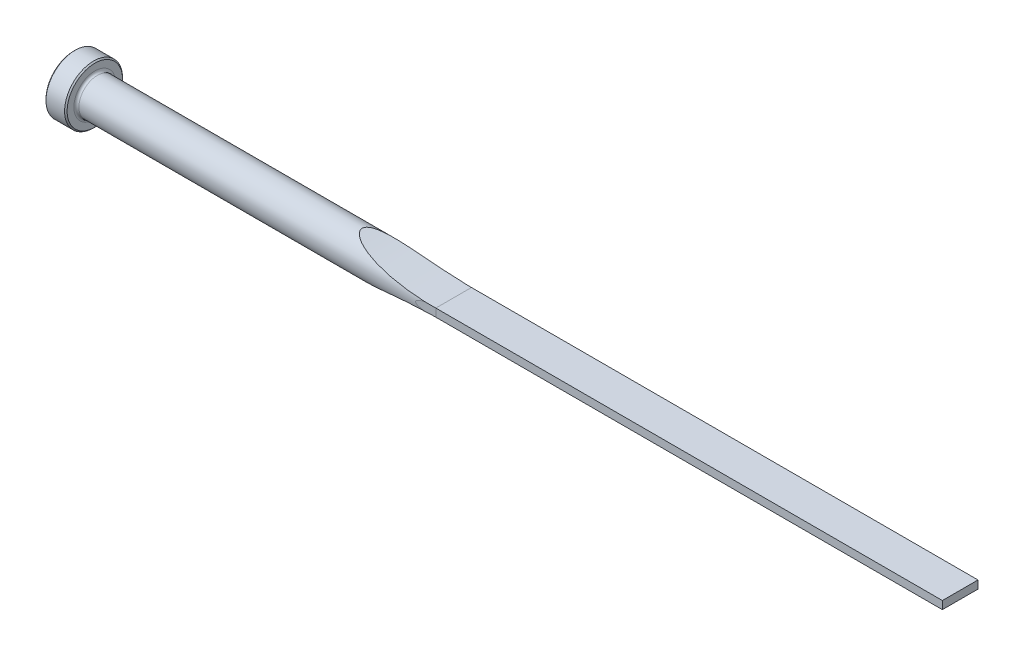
ISO-10303-21;
HEADER;
FILE_DESCRIPTION(('STEP AP214'),'2;1');
FILE_NAME('part.step','',(''),(''),'','','');
FILE_SCHEMA(('AUTOMOTIVE_DESIGN { 1 0 10303 214 1 1 1 1 }'));
ENDSEC;
DATA;
#1=APPLICATION_CONTEXT('core data for automotive mechanical design processes');
#2=APPLICATION_PROTOCOL_DEFINITION('international standard','automotive_design',2000,#1);
#3=PRODUCT_CONTEXT('',#1,'mechanical');
#4=PRODUCT('Part','Part','',(#3));
#5=PRODUCT_RELATED_PRODUCT_CATEGORY('part','',(#4));
#6=PRODUCT_DEFINITION_FORMATION('','',#4);
#7=PRODUCT_DEFINITION_CONTEXT('part definition',#1,'design');
#8=PRODUCT_DEFINITION('design','',#6,#7);
#9=PRODUCT_DEFINITION_SHAPE('','',#8);
#10=(LENGTH_UNIT() NAMED_UNIT(*) SI_UNIT(.MILLI.,.METRE.));
#11=(NAMED_UNIT(*) PLANE_ANGLE_UNIT() SI_UNIT($,.RADIAN.));
#12=(NAMED_UNIT(*) SI_UNIT($,.STERADIAN.) SOLID_ANGLE_UNIT());
#13=UNCERTAINTY_MEASURE_WITH_UNIT(LENGTH_MEASURE(1.E-05),#10,'distance_accuracy_value','');
#14=(GEOMETRIC_REPRESENTATION_CONTEXT(3) GLOBAL_UNCERTAINTY_ASSIGNED_CONTEXT((#13)) GLOBAL_UNIT_ASSIGNED_CONTEXT((#10,
#11,#12)) REPRESENTATION_CONTEXT('',''));
#15=CARTESIAN_POINT('',(0.,0.,0.));
#16=DIRECTION('',(0.,0.,1.));
#17=DIRECTION('',(1.,0.,0.));
#18=AXIS2_PLACEMENT_3D('',#15,#16,#17);
#19=CARTESIAN_POINT('',(0.,0.,0.));
#20=DIRECTION('',(-1.,0.,0.));
#21=DIRECTION('',(0.,0.,1.));
#22=AXIS2_PLACEMENT_3D('',#19,#20,#21);
#23=CYLINDRICAL_SURFACE('',#22,5.55625);
#24=CARTESIAN_POINT('',(7.112,0.,0.));
#25=DIRECTION('',(-1.,0.,0.));
#26=DIRECTION('',(0.,0.,1.));
#27=AXIS2_PLACEMENT_3D('',#24,#25,#26);
#28=CIRCLE('',#27,5.55625);
#29=CARTESIAN_POINT('',(7.112,0.,5.55625));
#30=VERTEX_POINT('',#29);
#31=EDGE_CURVE('E153',#30,#30,#28,.F.);
#32=ORIENTED_EDGE('',*,*,#31,.T.);
#33=EDGE_LOOP('',(#32));
#34=FACE_BOUND('',#33,.T.);
#35=CARTESIAN_POINT('',(114.3,1.46586005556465,5.3594));
#36=CARTESIAN_POINT('',(114.030271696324,1.46575873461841,5.35939756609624));
#37=CARTESIAN_POINT('',(113.760518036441,1.46136420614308,5.36062746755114));
#38=CARTESIAN_POINT('',(113.22105926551,1.44329060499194,5.36553852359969));
#39=CARTESIAN_POINT('',(112.951354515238,1.42960160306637,5.36922229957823));
#40=CARTESIAN_POINT('',(112.410495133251,1.39208721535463,5.37906724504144));
#41=CARTESIAN_POINT('',(112.139346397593,1.36818081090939,5.38524819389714));
#42=CARTESIAN_POINT('',(111.598495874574,1.30859070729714,5.40004505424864));
#43=CARTESIAN_POINT('',(111.328793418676,1.27291303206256,5.40865971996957));
#44=CARTESIAN_POINT('',(110.926651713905,1.20828013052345,5.42332376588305));
#45=CARTESIAN_POINT('',(110.793273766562,1.1849414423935,5.42848992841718));
#46=CARTESIAN_POINT('',(110.527337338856,1.13387487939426,5.43938691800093));
#47=CARTESIAN_POINT('',(110.394779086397,1.10614583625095,5.44511789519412));
#48=CARTESIAN_POINT('',(110.130841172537,1.0453518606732,5.45711645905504));
#49=CARTESIAN_POINT('',(109.999461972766,1.01228492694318,5.46338424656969));
#50=CARTESIAN_POINT('',(109.738710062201,0.939342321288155,5.47639670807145));
#51=CARTESIAN_POINT('',(109.609336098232,0.899471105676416,5.48314106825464));
#52=CARTESIAN_POINT('',(109.35297395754,0.810175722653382,5.49705768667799));
#53=CARTESIAN_POINT('',(109.226002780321,0.760700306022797,5.50423209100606));
#54=CARTESIAN_POINT('',(109.040600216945,0.675638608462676,5.51508991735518));
#55=CARTESIAN_POINT('',(108.979683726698,0.645502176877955,5.51872258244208));
#56=CARTESIAN_POINT('',(108.860503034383,0.580424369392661,5.52594854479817));
#57=CARTESIAN_POINT('',(108.802234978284,0.545490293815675,5.52954189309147));
#58=CARTESIAN_POINT('',(108.701530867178,0.476724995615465,5.53584531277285));
#59=CARTESIAN_POINT('',(108.65827903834,0.444104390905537,5.53858683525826));
#60=CARTESIAN_POINT('',(108.57667277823,0.373234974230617,5.54381419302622));
#61=CARTESIAN_POINT('',(108.538296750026,0.335012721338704,5.5463011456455));
#62=CARTESIAN_POINT('',(108.487931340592,0.27269036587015,5.54959140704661));
#63=CARTESIAN_POINT('',(108.472506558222,0.251407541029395,5.55060383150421));
#64=CARTESIAN_POINT('',(108.444620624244,0.206926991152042,5.55244015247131));
#65=CARTESIAN_POINT('',(108.432159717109,0.183729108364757,5.55326403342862));
#66=CARTESIAN_POINT('',(108.411107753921,0.135176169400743,5.55465907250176));
#67=CARTESIAN_POINT('',(108.402575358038,0.109794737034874,5.5552263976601));
#68=CARTESIAN_POINT('',(108.390813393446,0.0578395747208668,5.55600913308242));
#69=CARTESIAN_POINT('',(108.387570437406,0.0312690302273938,5.55622543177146));
#70=CARTESIAN_POINT('',(108.386942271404,-0.0180209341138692,5.55626732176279));
#71=CARTESIAN_POINT('',(108.388766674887,-0.0407328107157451,5.55614563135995));
#72=CARTESIAN_POINT('',(108.396395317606,-0.085481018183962,5.55563758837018));
#73=CARTESIAN_POINT('',(108.402204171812,-0.107516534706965,5.5552509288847));
#74=CARTESIAN_POINT('',(108.419168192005,-0.156049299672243,5.5541244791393));
#75=CARTESIAN_POINT('',(108.431330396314,-0.18218719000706,5.55331838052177));
#76=CARTESIAN_POINT('',(108.459602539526,-0.232205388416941,5.55145244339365));
#77=CARTESIAN_POINT('',(108.475720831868,-0.256080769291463,5.55039206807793));
#78=CARTESIAN_POINT('',(108.523752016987,-0.318666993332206,5.54724818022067));
#79=CARTESIAN_POINT('',(108.558484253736,-0.355174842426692,5.54499107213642));
#80=CARTESIAN_POINT('',(108.63259156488,-0.423044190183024,5.54022572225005));
#81=CARTESIAN_POINT('',(108.671980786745,-0.454389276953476,5.5377167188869));
#82=CARTESIAN_POINT('',(108.774080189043,-0.527971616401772,5.53128741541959));
#83=CARTESIAN_POINT('',(108.838542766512,-0.567741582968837,5.5272928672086));
#84=CARTESIAN_POINT('',(108.970872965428,-0.641234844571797,5.51924650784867));
#85=CARTESIAN_POINT('',(109.038748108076,-0.67494396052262,5.51519458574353));
#86=CARTESIAN_POINT('',(109.176924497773,-0.738013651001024,5.50711039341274));
#87=CARTESIAN_POINT('',(109.247237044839,-0.767349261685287,5.50307835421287));
#88=CARTESIAN_POINT('',(109.389142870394,-0.822439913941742,5.4951136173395));
#89=CARTESIAN_POINT('',(109.46073462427,-0.848198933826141,5.49118081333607));
#90=CARTESIAN_POINT('',(109.669352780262,-0.91867444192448,5.47997799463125));
#91=CARTESIAN_POINT('',(109.807620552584,-0.959734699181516,5.47287002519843));
#92=CARTESIAN_POINT('',(110.086165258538,-1.03455813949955,5.45921359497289));
#93=CARTESIAN_POINT('',(110.22644336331,-1.06831686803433,5.45266547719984));
#94=CARTESIAN_POINT('',(110.649735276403,-1.16124457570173,5.43392318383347));
#95=CARTESIAN_POINT('',(110.934656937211,-1.21189726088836,5.42266076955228));
#96=CARTESIAN_POINT('',(111.506839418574,-1.29737509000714,5.40282806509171));
#97=CARTESIAN_POINT('',(111.794100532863,-1.33219821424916,5.39425811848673));
#98=CARTESIAN_POINT('',(112.369614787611,-1.3890650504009,5.37989532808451));
#99=CARTESIAN_POINT('',(112.657866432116,-1.41112322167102,5.37409934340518));
#100=CARTESIAN_POINT('',(113.172284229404,-1.4405827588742,5.36626590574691));
#101=CARTESIAN_POINT('',(113.398325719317,-1.45012786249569,5.36368531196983));
#102=CARTESIAN_POINT('',(113.849579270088,-1.46273038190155,5.36025582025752));
#103=CARTESIAN_POINT('',(114.074790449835,-1.46581699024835,5.35939913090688));
#104=CARTESIAN_POINT('',(114.3,-1.46586005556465,5.3594));
#105=B_SPLINE_CURVE_WITH_KNOTS('',3,(#35,#36,#37,#38,#39,#40,#41,#42,#43,#44,#45,#46,#47,#48,
#49,#50,#51,#52,#53,#54,#55,#56,#57,#58,#59,#60,#61,#62,#63,#64,#65,#66,#67,#68,#69,#70,#71,#72,
#73,#74,#75,#76,#77,#78,#79,#80,#81,#82,#83,#84,#85,#86,#87,#88,#89,#90,#91,#92,#93,#94,#95,#96,
#97,#98,#99,#100,#101,#102,#103,#104),.UNSPECIFIED.,.F.,.F.,(4,2,2,2,2,2,2,2,2,2,2,2,2,2,2,2,2,
2,2,2,2,2,2,2,2,2,2,2,2,2,2,2,2,2,4),(0.,0.809188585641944,1.61924298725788,2.43584347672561,
3.25202671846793,3.65847781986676,4.06503726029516,4.47174948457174,4.87819635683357,
5.28687485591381,5.49092082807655,5.694659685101,5.85711909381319,6.01883176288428,
6.09756631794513,6.17630736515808,6.25618880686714,6.33586775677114,6.40384405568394,
6.47189922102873,6.5579348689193,6.64415377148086,6.79462229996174,6.94556028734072,
7.17253298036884,7.40002994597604,7.62877945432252,7.85727244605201,8.29017865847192,
8.72334823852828,9.59140829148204,10.4595790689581,11.326764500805,12.0054446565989,
12.6810504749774),.UNSPECIFIED.);
#106=CARTESIAN_POINT('',(111.180420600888,1.24855125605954,5.41415125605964));
#107=VERTEX_POINT('',#106);
#108=CARTESIAN_POINT('',(111.180420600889,-1.24855125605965,5.41415125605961));
#109=VERTEX_POINT('',#108);
#110=EDGE_CURVE('E156',#107,#109,#105,.T.);
#111=ORIENTED_EDGE('',*,*,#110,.F.);
#112=CARTESIAN_POINT('',(114.3,1.19379999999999,5.42648648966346));
#113=CARTESIAN_POINT('',(113.836278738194,1.19379960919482,5.42647003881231));
#114=CARTESIAN_POINT('',(113.372557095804,1.19742828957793,5.42568766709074));
#115=CARTESIAN_POINT('',(112.445230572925,1.21194105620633,5.42247326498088));
#116=CARTESIAN_POINT('',(111.981625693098,1.22282518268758,5.42004122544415));
#117=CARTESIAN_POINT('',(111.05456158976,1.25184904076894,5.41340899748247));
#118=CARTESIAN_POINT('',(110.591102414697,1.26999023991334,5.40920845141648));
#119=CARTESIAN_POINT('',(109.664547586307,1.31352246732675,5.39880331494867));
#120=CARTESIAN_POINT('',(109.201451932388,1.33891348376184,5.39259872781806));
#121=CARTESIAN_POINT('',(108.274618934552,1.39700801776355,5.37784182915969));
#122=CARTESIAN_POINT('',(107.810882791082,1.42972926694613,5.3692838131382));
#123=CARTESIAN_POINT('',(106.884040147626,1.50243687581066,5.34939418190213));
#124=CARTESIAN_POINT('',(106.420933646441,1.54242322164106,5.33806257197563));
#125=CARTESIAN_POINT('',(105.495541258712,1.62964076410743,5.31208608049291));
#126=CARTESIAN_POINT('',(105.033255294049,1.67687122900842,5.29744153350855));
#127=CARTESIAN_POINT('',(104.109628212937,1.7785567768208,5.26417167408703));
#128=CARTESIAN_POINT('',(103.648287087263,1.83301178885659,5.24554640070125));
#129=CARTESIAN_POINT('',(102.462749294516,1.98237592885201,5.19149175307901));
#130=CARTESIAN_POINT('',(101.739369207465,2.08258931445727,5.1525481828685));
#131=CARTESIAN_POINT('',(100.296154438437,2.30066319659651,5.05895286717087));
#132=CARTESIAN_POINT('',(99.5763201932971,2.41852581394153,5.00429923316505));
#133=CARTESIAN_POINT('',(98.5002084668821,2.60831906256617,4.90648551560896));
#134=CARTESIAN_POINT('',(98.1420552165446,2.67376132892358,4.87123528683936));
#135=CARTESIAN_POINT('',(97.4272204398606,2.80891244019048,4.79457790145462));
#136=CARTESIAN_POINT('',(97.070538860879,2.87862113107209,4.75317096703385));
#137=CARTESIAN_POINT('',(96.3590122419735,3.02220506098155,4.66319279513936));
#138=CARTESIAN_POINT('',(96.0041667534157,3.09607922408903,4.61462340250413));
#139=CARTESIAN_POINT('',(95.2966165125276,3.24788864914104,4.50906707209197));
#140=CARTESIAN_POINT('',(94.9439116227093,3.3258236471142,4.4520806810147));
#141=CARTESIAN_POINT('',(94.2402644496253,3.48578947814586,4.32798668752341));
#142=CARTESIAN_POINT('',(93.8893286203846,3.56782989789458,4.26085457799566));
#143=CARTESIAN_POINT('',(93.1907815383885,3.73559284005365,4.11456616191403));
#144=CARTESIAN_POINT('',(92.8431707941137,3.82131591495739,4.0354080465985));
#145=CARTESIAN_POINT('',(92.1534736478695,3.9957895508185,3.86272579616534));
#146=CARTESIAN_POINT('',(91.8113731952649,4.08452961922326,3.76924813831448));
#147=CARTESIAN_POINT('',(91.3029301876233,4.21961545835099,3.61543612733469));
#148=CARTESIAN_POINT('',(91.1342561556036,4.26496713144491,3.56190764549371));
#149=CARTESIAN_POINT('',(90.7987815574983,4.35621823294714,3.44971264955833));
#150=CARTESIAN_POINT('',(90.6319808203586,4.40211761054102,3.39104660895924));
#151=CARTESIAN_POINT('',(90.319668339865,4.48902868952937,3.27493062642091));
#152=CARTESIAN_POINT('',(90.1739098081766,4.52999694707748,3.21811345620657));
#153=CARTESIAN_POINT('',(89.88458367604,4.6121057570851,3.09929221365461));
#154=CARTESIAN_POINT('',(89.7410158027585,4.65324628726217,3.03728879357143));
#155=CARTESIAN_POINT('',(89.4558597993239,4.73572579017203,2.90702443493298));
#156=CARTESIAN_POINT('',(89.3142851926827,4.7770647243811,2.83873370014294));
#157=CARTESIAN_POINT('',(89.0346051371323,4.85946967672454,2.69523964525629));
#158=CARTESIAN_POINT('',(88.8964991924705,4.90053573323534,2.62003732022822));
#159=CARTESIAN_POINT('',(88.6225864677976,4.98268911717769,2.46027026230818));
#160=CARTESIAN_POINT('',(88.4868524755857,5.02376614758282,2.37557431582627));
#161=CARTESIAN_POINT('',(88.2215073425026,5.10473330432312,2.19620380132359));
#162=CARTESIAN_POINT('',(88.0919015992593,5.14462237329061,2.10152066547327));
#163=CARTESIAN_POINT('',(87.8424200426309,5.22199445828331,1.90109250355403));
#164=CARTESIAN_POINT('',(87.7224760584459,5.2594938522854,1.79543978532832));
#165=CARTESIAN_POINT('',(87.4952730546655,5.33100920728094,1.5704035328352));
#166=CARTESIAN_POINT('',(87.3879841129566,5.36503335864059,1.45105375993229));
#167=CARTESIAN_POINT('',(87.221020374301,5.41827719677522,1.23397684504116));
#168=CARTESIAN_POINT('',(87.1566354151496,5.43890352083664,1.14025492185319));
#169=CARTESIAN_POINT('',(87.0403051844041,5.47629138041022,0.944493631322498));
#170=CARTESIAN_POINT('',(86.9883608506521,5.49305262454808,0.842453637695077));
#171=CARTESIAN_POINT('',(86.9002998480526,5.52153134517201,0.629482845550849));
#172=CARTESIAN_POINT('',(86.8643751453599,5.53318761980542,0.51846211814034));
#173=CARTESIAN_POINT('',(86.8133120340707,5.54977153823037,0.291274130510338));
#174=CARTESIAN_POINT('',(86.7981383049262,5.55471061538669,0.175115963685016));
#175=CARTESIAN_POINT('',(86.7909471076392,5.55705054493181,-0.0464774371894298));
#176=CARTESIAN_POINT('',(86.7967908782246,5.55514764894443,-0.151838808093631));
#177=CARTESIAN_POINT('',(86.8262526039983,5.54556861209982,-0.3597809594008));
#178=CARTESIAN_POINT('',(86.8498845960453,5.53788791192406,-0.462359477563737));
#179=CARTESIAN_POINT('',(86.9190753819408,5.51545450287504,-0.682944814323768));
#180=CARTESIAN_POINT('',(86.9681812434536,5.49956032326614,-0.79970306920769));
#181=CARTESIAN_POINT('',(87.0835728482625,5.46236530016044,-1.02343794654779));
#182=CARTESIAN_POINT('',(87.1498921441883,5.4410538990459,-1.13039490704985));
#183=CARTESIAN_POINT('',(87.2814328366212,5.39898975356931,-1.31531443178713));
#184=CARTESIAN_POINT('',(87.3445462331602,5.37887596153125,-1.3949614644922));
#185=CARTESIAN_POINT('',(87.4772025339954,5.33678035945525,-1.54822827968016));
#186=CARTESIAN_POINT('',(87.5467497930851,5.31479728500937,-1.62184391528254));
#187=CARTESIAN_POINT('',(87.6909456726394,5.26942876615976,-1.76368634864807));
#188=CARTESIAN_POINT('',(87.7656040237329,5.24604065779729,-1.83190230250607));
#189=CARTESIAN_POINT('',(87.9188279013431,5.19827477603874,-1.96334885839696));
#190=CARTESIAN_POINT('',(87.9973925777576,5.17389721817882,-2.02658053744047));
#191=CARTESIAN_POINT('',(88.1805124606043,5.1173681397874,-2.16601659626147));
#192=CARTESIAN_POINT('',(88.2860907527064,5.08498201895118,-2.24077876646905));
#193=CARTESIAN_POINT('',(88.5012459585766,5.01943855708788,-2.38397431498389));
#194=CARTESIAN_POINT('',(88.6108244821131,4.98628090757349,-2.45240510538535));
#195=CARTESIAN_POINT('',(88.9445153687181,4.88603485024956,-2.64961446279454));
#196=CARTESIAN_POINT('',(89.1733168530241,4.81825572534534,-2.77011541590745));
#197=CARTESIAN_POINT('',(89.6400743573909,4.68210518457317,-2.99450065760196));
#198=CARTESIAN_POINT('',(89.8780706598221,4.61373250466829,-3.09829825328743));
#199=CARTESIAN_POINT('',(90.2392238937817,4.51164813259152,-3.24351905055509));
#200=CARTESIAN_POINT('',(90.3602534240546,4.4777122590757,-3.29016389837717));
#201=CARTESIAN_POINT('',(90.6035394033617,4.4100577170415,-3.38030843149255));
#202=CARTESIAN_POINT('',(90.7257958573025,4.37633904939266,-3.42380810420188));
#203=CARTESIAN_POINT('',(91.0470474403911,4.28848246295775,-3.53389507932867));
#204=CARTESIAN_POINT('',(91.2468924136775,4.23456967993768,-3.59818566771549));
#205=CARTESIAN_POINT('',(91.6487914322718,4.12766698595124,-3.72032881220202));
#206=CARTESIAN_POINT('',(91.8508457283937,4.07467718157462,-3.77818062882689));
#207=CARTESIAN_POINT('',(92.4598643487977,3.91727056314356,-3.9433687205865));
#208=CARTESIAN_POINT('',(92.8695359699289,3.81445719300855,-4.04228829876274));
#209=CARTESIAN_POINT('',(93.6946456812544,3.61368582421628,-4.22271910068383));
#210=CARTESIAN_POINT('',(94.1100933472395,3.51573754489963,-4.30419647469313));
#211=CARTESIAN_POINT('',(94.9447952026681,3.32531890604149,-4.45294934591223));
#212=CARTESIAN_POINT('',(95.3640498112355,3.23284915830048,-4.52022325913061));
#213=CARTESIAN_POINT('',(96.2069579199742,3.05336000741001,-4.64335849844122));
#214=CARTESIAN_POINT('',(96.6306217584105,2.96636114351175,-4.69917841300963));
#215=CARTESIAN_POINT('',(97.480303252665,2.79835129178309,-4.80112404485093));
#216=CARTESIAN_POINT('',(97.9063210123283,2.71734057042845,-4.84724933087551));
#217=CARTESIAN_POINT('',(98.7597817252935,2.56152263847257,-4.93136301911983));
#218=CARTESIAN_POINT('',(99.1872225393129,2.48670855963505,-4.96936050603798));
#219=CARTESIAN_POINT('',(100.04368766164,2.34326667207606,-5.0385861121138));
#220=CARTESIAN_POINT('',(100.472711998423,2.27463897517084,-5.06981410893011));
#221=CARTESIAN_POINT('',(101.460165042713,2.12410662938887,-5.1350452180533));
#222=CARTESIAN_POINT('',(102.019049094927,2.04434163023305,-5.16710113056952));
#223=CARTESIAN_POINT('',(103.138617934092,1.89542994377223,-5.22356084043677));
#224=CARTESIAN_POINT('',(103.699302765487,1.82628352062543,-5.24796444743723));
#225=CARTESIAN_POINT('',(104.822391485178,1.69863893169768,-5.29065870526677));
#226=CARTESIAN_POINT('',(105.384796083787,1.64014602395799,-5.30894634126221));
#227=CARTESIAN_POINT('',(106.510755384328,1.53389122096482,-5.34061439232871));
#228=CARTESIAN_POINT('',(107.074310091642,1.48612937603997,-5.353994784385));
#229=CARTESIAN_POINT('',(108.192538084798,1.40209905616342,-5.37660600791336));
#230=CARTESIAN_POINT('',(108.747196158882,1.36564586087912,-5.38590468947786));
#231=CARTESIAN_POINT('',(109.857142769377,1.30314736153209,-5.40136553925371));
#232=CARTESIAN_POINT('',(110.412431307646,1.2771020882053,-5.40752769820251));
#233=CARTESIAN_POINT('',(111.523000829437,1.23544750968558,-5.41720096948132));
#234=CARTESIAN_POINT('',(112.078281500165,1.21983031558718,-5.42071408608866));
#235=CARTESIAN_POINT('',(113.189041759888,1.19900621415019,-5.42533985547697));
#236=CARTESIAN_POINT('',(113.744521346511,1.19379918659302,-5.42645253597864));
#237=CARTESIAN_POINT('',(114.3,1.1938,-5.42648648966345));
#238=B_SPLINE_CURVE_WITH_KNOTS('',3,(#112,#113,#114,#115,#116,#117,#118,#119,#120,#121,#122,
#123,#124,#125,#126,#127,#128,#129,#130,#131,#132,#133,#134,#135,#136,#137,#138,#139,#140,#141,
#142,#143,#144,#145,#146,#147,#148,#149,#150,#151,#152,#153,#154,#155,#156,#157,#158,#159,#160,
#161,#162,#163,#164,#165,#166,#167,#168,#169,#170,#171,#172,#173,#174,#175,#176,#177,#178,#179,
#180,#181,#182,#183,#184,#185,#186,#187,#188,#189,#190,#191,#192,#193,#194,#195,#196,#197,#198,
#199,#200,#201,#202,#203,#204,#205,#206,#207,#208,#209,#210,#211,#212,#213,#214,#215,#216,#217,
#218,#219,#220,#221,#222,#223,#224,#225,#226,#227,#228,#229,#230,#231,#232,#233,#234,#235,#236,
#237),.UNSPECIFIED.,.F.,.F.,(4,2,2,2,2,2,2,2,2,2,2,2,2,2,2,2,2,2,2,2,2,2,2,2,2,2,2,2,2,2,2,2,2,
2,2,2,2,2,2,2,2,2,2,2,2,2,2,2,2,2,2,2,2,2,2,2,2,2,2,2,2,2,4),(0.,1.39114954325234,
2.78230680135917,4.17374552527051,5.56518197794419,6.96002133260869,8.35485802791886,
9.74955392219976,11.1442361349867,13.3378673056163,15.5317622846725,16.6290544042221,
17.7263069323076,18.8232773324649,19.9201765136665,21.0197689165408,22.1195268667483,
23.2157881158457,23.7637714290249,24.3117042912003,24.7967694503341,25.2817736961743,
25.7692080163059,26.256572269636,26.7517811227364,27.2474183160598,27.73917908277,
28.2297527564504,28.5756325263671,28.9215383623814,29.2714846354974,29.6208345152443,
29.9356852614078,30.2507847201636,30.6316520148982,31.0132673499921,31.323614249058,
31.6341727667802,31.945339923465,32.2564396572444,32.6562491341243,33.0562213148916,
33.8571806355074,34.6621715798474,35.0643534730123,35.466536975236,36.1166299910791,
36.7667975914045,38.0676169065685,39.370938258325,40.6744048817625,41.9825041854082,
43.2906616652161,44.5973492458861,45.9040604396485,47.6002551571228,49.2964920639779,
50.9935638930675,52.6906436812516,54.3583330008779,56.0260272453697,57.6924584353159,
59.3588703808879),.UNSPECIFIED.);
#239=CARTESIAN_POINT('',(111.180420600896,1.24855125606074,-5.41415125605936));
#240=VERTEX_POINT('',#239);
#241=EDGE_CURVE('E106',#107,#240,#238,.T.);
#242=ORIENTED_EDGE('',*,*,#241,.T.);
#243=CARTESIAN_POINT('',(114.3,1.46586005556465,-5.3594));
#244=CARTESIAN_POINT('',(114.030271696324,1.46575873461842,-5.35939756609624));
#245=CARTESIAN_POINT('',(113.760518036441,1.4613642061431,-5.36062746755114));
#246=CARTESIAN_POINT('',(113.22105926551,1.44329060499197,-5.36553852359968));
#247=CARTESIAN_POINT('',(112.951354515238,1.42960160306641,-5.36922229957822));
#248=CARTESIAN_POINT('',(112.410495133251,1.39208721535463,-5.37906724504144));
#249=CARTESIAN_POINT('',(112.139346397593,1.36818081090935,-5.38524819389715));
#250=CARTESIAN_POINT('',(111.598495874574,1.30859070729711,-5.40004505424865));
#251=CARTESIAN_POINT('',(111.328793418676,1.27291303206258,-5.40865971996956));
#252=CARTESIAN_POINT('',(110.926651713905,1.20828013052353,-5.42332376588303));
#253=CARTESIAN_POINT('',(110.793273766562,1.18494144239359,-5.42848992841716));
#254=CARTESIAN_POINT('',(110.527337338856,1.1338748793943,-5.43938691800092));
#255=CARTESIAN_POINT('',(110.394779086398,1.10614583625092,-5.44511789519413));
#256=CARTESIAN_POINT('',(110.130841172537,1.04535186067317,-5.45711645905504));
#257=CARTESIAN_POINT('',(109.999461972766,1.0122849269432,-5.46338424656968));
#258=CARTESIAN_POINT('',(109.738710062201,0.939342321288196,-5.47639670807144));
#259=CARTESIAN_POINT('',(109.609336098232,0.899471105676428,-5.48314106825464));
#260=CARTESIAN_POINT('',(109.352973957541,0.810175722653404,-5.49705768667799));
#261=CARTESIAN_POINT('',(109.226002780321,0.760700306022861,-5.50423209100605));
#262=CARTESIAN_POINT('',(109.040600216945,0.675638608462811,-5.51508991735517));
#263=CARTESIAN_POINT('',(108.979683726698,0.645502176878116,-5.51872258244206));
#264=CARTESIAN_POINT('',(108.860503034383,0.580424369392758,-5.52594854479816));
#265=CARTESIAN_POINT('',(108.802234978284,0.545490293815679,-5.52954189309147));
#266=CARTESIAN_POINT('',(108.701530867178,0.476724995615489,-5.53584531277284));
#267=CARTESIAN_POINT('',(108.65827903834,0.444104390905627,-5.53858683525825));
#268=CARTESIAN_POINT('',(108.57667277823,0.373234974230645,-5.54381419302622));
#269=CARTESIAN_POINT('',(108.538296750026,0.335012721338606,-5.5463011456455));
#270=CARTESIAN_POINT('',(108.487931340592,0.272690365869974,-5.54959140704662));
#271=CARTESIAN_POINT('',(108.472506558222,0.251407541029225,-5.55060383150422));
#272=CARTESIAN_POINT('',(108.444620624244,0.206926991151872,-5.55244015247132));
#273=CARTESIAN_POINT('',(108.432159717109,0.183729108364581,-5.55326403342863));
#274=CARTESIAN_POINT('',(108.411107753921,0.135176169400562,-5.55465907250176));
#275=CARTESIAN_POINT('',(108.402575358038,0.109794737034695,-5.55522639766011));
#276=CARTESIAN_POINT('',(108.390813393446,0.0578395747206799,-5.55600913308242));
#277=CARTESIAN_POINT('',(108.387570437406,0.0312690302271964,-5.55622543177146));
#278=CARTESIAN_POINT('',(108.386942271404,-0.0180209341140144,-5.55626732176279));
#279=CARTESIAN_POINT('',(108.388766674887,-0.0407328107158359,-5.55614563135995));
#280=CARTESIAN_POINT('',(108.396395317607,-0.0854810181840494,-5.55563758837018));
#281=CARTESIAN_POINT('',(108.402204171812,-0.107516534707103,-5.55525092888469));
#282=CARTESIAN_POINT('',(108.419168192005,-0.156049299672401,-5.55412447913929));
#283=CARTESIAN_POINT('',(108.431330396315,-0.18218719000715,-5.55331838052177));
#284=CARTESIAN_POINT('',(108.459602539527,-0.232205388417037,-5.55145244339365));
#285=CARTESIAN_POINT('',(108.475720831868,-0.256080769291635,-5.55039206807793));
#286=CARTESIAN_POINT('',(108.523752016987,-0.318666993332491,-5.54724818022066));
#287=CARTESIAN_POINT('',(108.558484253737,-0.355174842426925,-5.54499107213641));
#288=CARTESIAN_POINT('',(108.632591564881,-0.423044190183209,-5.54022572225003));
#289=CARTESIAN_POINT('',(108.671980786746,-0.454389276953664,-5.53771671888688));
#290=CARTESIAN_POINT('',(108.774080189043,-0.527971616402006,-5.53128741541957));
#291=CARTESIAN_POINT('',(108.838542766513,-0.567741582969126,-5.52729286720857));
#292=CARTESIAN_POINT('',(108.970872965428,-0.641234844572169,-5.51924650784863));
#293=CARTESIAN_POINT('',(109.038748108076,-0.674943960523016,-5.51519458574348));
#294=CARTESIAN_POINT('',(109.176924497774,-0.738013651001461,-5.50711039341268));
#295=CARTESIAN_POINT('',(109.24723704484,-0.767349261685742,-5.5030783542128));
#296=CARTESIAN_POINT('',(109.389142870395,-0.822439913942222,-5.49511361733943));
#297=CARTESIAN_POINT('',(109.460734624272,-0.848198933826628,-5.491180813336));
#298=CARTESIAN_POINT('',(109.669352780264,-0.918674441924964,-5.47997799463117));
#299=CARTESIAN_POINT('',(109.807620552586,-0.95973469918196,-5.47287002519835));
#300=CARTESIAN_POINT('',(110.08616525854,-1.03455813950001,-5.4592135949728));
#301=CARTESIAN_POINT('',(110.226443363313,-1.06831686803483,-5.45266547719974));
#302=CARTESIAN_POINT('',(110.649735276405,-1.16124457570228,-5.43392318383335));
#303=CARTESIAN_POINT('',(110.934656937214,-1.21189726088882,-5.42266076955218));
#304=CARTESIAN_POINT('',(111.506839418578,-1.29737509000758,-5.4028280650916));
#305=CARTESIAN_POINT('',(111.794100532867,-1.33219821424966,-5.39425811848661));
#306=CARTESIAN_POINT('',(112.369614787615,-1.38906505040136,-5.37989532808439));
#307=CARTESIAN_POINT('',(112.657866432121,-1.41112322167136,-5.37409934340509));
#308=CARTESIAN_POINT('',(113.172284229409,-1.44058275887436,-5.36626590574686));
#309=CARTESIAN_POINT('',(113.398325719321,-1.45012786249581,-5.3636853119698));
#310=CARTESIAN_POINT('',(113.84957927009,-1.46273038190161,-5.3602558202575));
#311=CARTESIAN_POINT('',(114.074790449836,-1.46581699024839,-5.35939913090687));
#312=CARTESIAN_POINT('',(114.3,-1.46586005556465,-5.3594));
#313=B_SPLINE_CURVE_WITH_KNOTS('',3,(#243,#244,#245,#246,#247,#248,#249,#250,#251,#252,#253,
#254,#255,#256,#257,#258,#259,#260,#261,#262,#263,#264,#265,#266,#267,#268,#269,#270,#271,#272,
#273,#274,#275,#276,#277,#278,#279,#280,#281,#282,#283,#284,#285,#286,#287,#288,#289,#290,#291,
#292,#293,#294,#295,#296,#297,#298,#299,#300,#301,#302,#303,#304,#305,#306,#307,#308,#309,#310,
#311,#312),.UNSPECIFIED.,.F.,.F.,(4,2,2,2,2,2,2,2,2,2,2,2,2,2,2,2,2,2,2,2,2,2,2,2,2,2,2,2,2,2,2,
2,2,2,4),(0.,0.809188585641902,1.61924298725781,2.43584347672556,3.25202671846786,
3.65847781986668,4.06503726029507,4.47174948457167,4.87819635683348,5.28687485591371,
5.49092082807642,5.69465968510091,5.85711909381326,6.01883176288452,6.09756631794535,
6.1763073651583,6.25618880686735,6.33586775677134,6.40384405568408,6.47189922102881,
6.55793486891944,6.64415377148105,6.79462229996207,6.94556028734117,7.17253298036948,
7.40002994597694,7.62877945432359,7.85727244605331,8.29017865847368,8.72334823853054,
9.59140829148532,10.4595790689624,11.3267645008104,12.0054446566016,12.6810504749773),.UNSPECIFIED.);
#314=CARTESIAN_POINT('',(111.18042060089,-1.24855125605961,-5.4141512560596));
#315=VERTEX_POINT('',#314);
#316=EDGE_CURVE('E175',#240,#315,#313,.T.);
#317=ORIENTED_EDGE('',*,*,#316,.T.);
#318=CARTESIAN_POINT('',(114.3,-1.19379999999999,5.42648648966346));
#319=CARTESIAN_POINT('',(113.836278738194,-1.19379960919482,5.4264700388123));
#320=CARTESIAN_POINT('',(113.372557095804,-1.19742828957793,5.42568766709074));
#321=CARTESIAN_POINT('',(112.445230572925,-1.21194105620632,5.42247326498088));
#322=CARTESIAN_POINT('',(111.981625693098,-1.22282518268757,5.42004122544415));
#323=CARTESIAN_POINT('',(111.05456158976,-1.25184904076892,5.41340899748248));
#324=CARTESIAN_POINT('',(110.591102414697,-1.26999023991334,5.40920845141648));
#325=CARTESIAN_POINT('',(109.664547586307,-1.31352246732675,5.39880331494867));
#326=CARTESIAN_POINT('',(109.201451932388,-1.33891348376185,5.39259872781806));
#327=CARTESIAN_POINT('',(108.274618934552,-1.39700801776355,5.3778418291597));
#328=CARTESIAN_POINT('',(107.810882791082,-1.42972926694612,5.36928381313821));
#329=CARTESIAN_POINT('',(106.884040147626,-1.50243687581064,5.34939418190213));
#330=CARTESIAN_POINT('',(106.420933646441,-1.54242322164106,5.33806257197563));
#331=CARTESIAN_POINT('',(105.495541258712,-1.62964076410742,5.31208608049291));
#332=CARTESIAN_POINT('',(105.033255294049,-1.6768712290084,5.29744153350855));
#333=CARTESIAN_POINT('',(104.109628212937,-1.7785567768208,5.26417167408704));
#334=CARTESIAN_POINT('',(103.648287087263,-1.83301178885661,5.24554640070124));
#335=CARTESIAN_POINT('',(102.462749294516,-1.98237592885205,5.191491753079));
#336=CARTESIAN_POINT('',(101.739369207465,-2.08258931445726,5.15254818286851));
#337=CARTESIAN_POINT('',(100.296154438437,-2.30066319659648,5.05895286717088));
#338=CARTESIAN_POINT('',(99.5763201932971,-2.41852581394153,5.00429923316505));
#339=CARTESIAN_POINT('',(98.5002084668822,-2.60831906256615,4.90648551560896));
#340=CARTESIAN_POINT('',(98.1420552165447,-2.67376132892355,4.87123528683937));
#341=CARTESIAN_POINT('',(97.4272204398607,-2.80891244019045,4.79457790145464));
#342=CARTESIAN_POINT('',(97.0705388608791,-2.87862113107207,4.75317096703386));
#343=CARTESIAN_POINT('',(96.3590122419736,-3.02220506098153,4.66319279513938));
#344=CARTESIAN_POINT('',(96.0041667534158,-3.096079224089,4.61462340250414));
#345=CARTESIAN_POINT('',(95.2966165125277,-3.24788864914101,4.50906707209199));
#346=CARTESIAN_POINT('',(94.9439116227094,-3.32582364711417,4.45208068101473));
#347=CARTESIAN_POINT('',(94.2402644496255,-3.48578947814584,4.32798668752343));
#348=CARTESIAN_POINT('',(93.8893286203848,-3.56782989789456,4.26085457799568));
#349=CARTESIAN_POINT('',(93.1907815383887,-3.73559284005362,4.11456616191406));
#350=CARTESIAN_POINT('',(92.8431707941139,-3.82131591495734,4.03540804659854));
#351=CARTESIAN_POINT('',(92.1534736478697,-3.99578955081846,3.86272579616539));
#352=CARTESIAN_POINT('',(91.8113731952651,-4.08452961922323,3.76924813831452));
#353=CARTESIAN_POINT('',(91.3029301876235,-4.21961545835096,3.61543612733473));
#354=CARTESIAN_POINT('',(91.1342561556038,-4.26496713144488,3.56190764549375));
#355=CARTESIAN_POINT('',(90.7987815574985,-4.3562182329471,3.44971264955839));
#356=CARTESIAN_POINT('',(90.6319808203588,-4.40211761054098,3.39104660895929));
#357=CARTESIAN_POINT('',(90.3196683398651,-4.48902868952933,3.27493062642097));
#358=CARTESIAN_POINT('',(90.1739098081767,-4.52999694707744,3.21811345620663));
#359=CARTESIAN_POINT('',(89.88458367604,-4.61210575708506,3.09929221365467));
#360=CARTESIAN_POINT('',(89.7410158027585,-4.65324628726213,3.03728879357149));
#361=CARTESIAN_POINT('',(89.4558597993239,-4.735725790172,2.90702443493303));
#362=CARTESIAN_POINT('',(89.3142851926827,-4.77706472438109,2.83873370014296));
#363=CARTESIAN_POINT('',(89.0346051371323,-4.85946967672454,2.69523964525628));
#364=CARTESIAN_POINT('',(88.8964991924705,-4.90053573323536,2.62003732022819));
#365=CARTESIAN_POINT('',(88.6225864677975,-4.98268911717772,2.46027026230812));
#366=CARTESIAN_POINT('',(88.4868524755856,-5.02376614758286,2.3755743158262));
#367=CARTESIAN_POINT('',(88.2215073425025,-5.10473330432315,2.19620380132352));
#368=CARTESIAN_POINT('',(88.0919015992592,-5.14462237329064,2.10152066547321));
#369=CARTESIAN_POINT('',(87.8424200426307,-5.22199445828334,1.90109250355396));
#370=CARTESIAN_POINT('',(87.7224760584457,-5.25949385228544,1.79543978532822));
#371=CARTESIAN_POINT('',(87.4952730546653,-5.33100920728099,1.57040353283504));
#372=CARTESIAN_POINT('',(87.3879841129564,-5.36503335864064,1.45105375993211));
#373=CARTESIAN_POINT('',(87.2210203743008,-5.41827719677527,1.23397684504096));
#374=CARTESIAN_POINT('',(87.1566354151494,-5.43890352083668,1.140254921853));
#375=CARTESIAN_POINT('',(87.040305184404,-5.47629138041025,0.944493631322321));
#376=CARTESIAN_POINT('',(86.9883608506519,-5.49305262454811,0.842453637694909));
#377=CARTESIAN_POINT('',(86.9002998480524,-5.52153134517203,0.629482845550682));
#378=CARTESIAN_POINT('',(86.8643751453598,-5.53318761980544,0.518462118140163));
#379=CARTESIAN_POINT('',(86.8133120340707,-5.54977153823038,0.29127413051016));
#380=CARTESIAN_POINT('',(86.7981383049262,-5.5547106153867,0.175115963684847));
#381=CARTESIAN_POINT('',(86.7909471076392,-5.55705054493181,-0.0464774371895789));
#382=CARTESIAN_POINT('',(86.7967908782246,-5.55514764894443,-0.151838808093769));
#383=CARTESIAN_POINT('',(86.8262526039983,-5.54556861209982,-0.359780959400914));
#384=CARTESIAN_POINT('',(86.8498845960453,-5.53788791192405,-0.462359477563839));
#385=CARTESIAN_POINT('',(86.9190753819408,-5.51545450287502,-0.682944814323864));
#386=CARTESIAN_POINT('',(86.9681812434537,-5.49956032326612,-0.79970306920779));
#387=CARTESIAN_POINT('',(87.0835728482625,-5.46236530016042,-1.02343794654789));
#388=CARTESIAN_POINT('',(87.1498921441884,-5.44105389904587,-1.13039490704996));
#389=CARTESIAN_POINT('',(87.2814328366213,-5.39898975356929,-1.31531443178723));
#390=CARTESIAN_POINT('',(87.3445462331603,-5.37887596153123,-1.3949614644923));
#391=CARTESIAN_POINT('',(87.4772025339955,-5.33678035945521,-1.54822827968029));
#392=CARTESIAN_POINT('',(87.5467497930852,-5.31479728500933,-1.62184391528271));
#393=CARTESIAN_POINT('',(87.6909456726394,-5.26942876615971,-1.76368634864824));
#394=CARTESIAN_POINT('',(87.7656040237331,-5.24604065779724,-1.83190230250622));
#395=CARTESIAN_POINT('',(87.9188279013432,-5.19827477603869,-1.96334885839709));
#396=CARTESIAN_POINT('',(87.9973925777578,-5.17389721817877,-2.02658053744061));
#397=CARTESIAN_POINT('',(88.1805124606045,-5.11736813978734,-2.16601659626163));
#398=CARTESIAN_POINT('',(88.2860907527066,-5.08498201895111,-2.24077876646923));
#399=CARTESIAN_POINT('',(88.5012459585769,-5.01943855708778,-2.38397431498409));
#400=CARTESIAN_POINT('',(88.6108244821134,-4.98628090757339,-2.45240510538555));
#401=CARTESIAN_POINT('',(88.9445153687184,-4.88603485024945,-2.64961446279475));
#402=CARTESIAN_POINT('',(89.1733168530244,-4.81825572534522,-2.77011541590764));
#403=CARTESIAN_POINT('',(89.6400743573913,-4.68210518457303,-2.99450065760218));
#404=CARTESIAN_POINT('',(89.8780706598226,-4.61373250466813,-3.09829825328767));
#405=CARTESIAN_POINT('',(90.2392238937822,-4.51164813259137,-3.24351905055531));
#406=CARTESIAN_POINT('',(90.3602534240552,-4.47771225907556,-3.29016389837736));
#407=CARTESIAN_POINT('',(90.6035394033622,-4.41005771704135,-3.38030843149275));
#408=CARTESIAN_POINT('',(90.7257958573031,-4.37633904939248,-3.4238081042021));
#409=CARTESIAN_POINT('',(91.0470474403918,-4.28848246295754,-3.53389507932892));
#410=CARTESIAN_POINT('',(91.2468924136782,-4.23456967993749,-3.59818566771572));
#411=CARTESIAN_POINT('',(91.6487914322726,-4.12766698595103,-3.72032881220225));
#412=CARTESIAN_POINT('',(91.8508457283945,-4.07467718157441,-3.77818062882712));
#413=CARTESIAN_POINT('',(92.4598643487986,-3.91727056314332,-3.94336872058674));
#414=CARTESIAN_POINT('',(92.86953596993,-3.81445719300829,-4.04228829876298));
#415=CARTESIAN_POINT('',(93.6946456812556,-3.61368582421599,-4.22271910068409));
#416=CARTESIAN_POINT('',(94.1100933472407,-3.51573754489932,-4.30419647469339));
#417=CARTESIAN_POINT('',(94.9447952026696,-3.32531890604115,-4.45294934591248));
#418=CARTESIAN_POINT('',(95.364049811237,-3.23284915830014,-4.52022325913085));
#419=CARTESIAN_POINT('',(96.2069579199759,-3.05336000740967,-4.64335849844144));
#420=CARTESIAN_POINT('',(96.6306217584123,-2.96636114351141,-4.69917841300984));
#421=CARTESIAN_POINT('',(97.4803032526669,-2.79835129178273,-4.80112404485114));
#422=CARTESIAN_POINT('',(97.9063210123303,-2.71734057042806,-4.84724933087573));
#423=CARTESIAN_POINT('',(98.7597817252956,-2.56152263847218,-4.93136301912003));
#424=CARTESIAN_POINT('',(99.1872225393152,-2.48670855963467,-4.96936050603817));
#425=CARTESIAN_POINT('',(100.043687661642,-2.34326667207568,-5.03858611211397));
#426=CARTESIAN_POINT('',(100.472711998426,-2.27463897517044,-5.06981410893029));
#427=CARTESIAN_POINT('',(101.460165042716,-2.12410662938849,-5.13504521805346));
#428=CARTESIAN_POINT('',(102.019049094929,-2.04434163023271,-5.16710113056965));
#429=CARTESIAN_POINT('',(103.138617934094,-1.89542994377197,-5.22356084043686));
#430=CARTESIAN_POINT('',(103.699302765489,-1.82628352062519,-5.24796444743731));
#431=CARTESIAN_POINT('',(104.82239148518,-1.69863893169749,-5.29065870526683));
#432=CARTESIAN_POINT('',(105.384796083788,-1.64014602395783,-5.30894634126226));
#433=CARTESIAN_POINT('',(106.510755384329,-1.5338912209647,-5.34061439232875));
#434=CARTESIAN_POINT('',(107.074310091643,-1.48612937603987,-5.35399478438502));
#435=CARTESIAN_POINT('',(108.1925380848,-1.40209905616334,-5.37660600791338));
#436=CARTESIAN_POINT('',(108.747196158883,-1.36564586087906,-5.38590468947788));
#437=CARTESIAN_POINT('',(109.857142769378,-1.30314736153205,-5.40136553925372));
#438=CARTESIAN_POINT('',(110.412431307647,-1.27710208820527,-5.40752769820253));
#439=CARTESIAN_POINT('',(111.523000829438,-1.23544750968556,-5.41720096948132));
#440=CARTESIAN_POINT('',(112.078281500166,-1.21983031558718,-5.42071408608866));
#441=CARTESIAN_POINT('',(113.189041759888,-1.19900621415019,-5.42533985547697));
#442=CARTESIAN_POINT('',(113.744521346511,-1.19379918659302,-5.42645253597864));
#443=CARTESIAN_POINT('',(114.3,-1.19379999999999,-5.42648648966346));
#444=B_SPLINE_CURVE_WITH_KNOTS('',3,(#318,#319,#320,#321,#322,#323,#324,#325,#326,#327,#328,
#329,#330,#331,#332,#333,#334,#335,#336,#337,#338,#339,#340,#341,#342,#343,#344,#345,#346,#347,
#348,#349,#350,#351,#352,#353,#354,#355,#356,#357,#358,#359,#360,#361,#362,#363,#364,#365,#366,
#367,#368,#369,#370,#371,#372,#373,#374,#375,#376,#377,#378,#379,#380,#381,#382,#383,#384,#385,
#386,#387,#388,#389,#390,#391,#392,#393,#394,#395,#396,#397,#398,#399,#400,#401,#402,#403,#404,
#405,#406,#407,#408,#409,#410,#411,#412,#413,#414,#415,#416,#417,#418,#419,#420,#421,#422,#423,
#424,#425,#426,#427,#428,#429,#430,#431,#432,#433,#434,#435,#436,#437,#438,#439,#440,#441,#442,
#443),.UNSPECIFIED.,.F.,.F.,(4,2,2,2,2,2,2,2,2,2,2,2,2,2,2,2,2,2,2,2,2,2,2,2,2,2,2,2,2,2,2,2,2,
2,2,2,2,2,2,2,2,2,2,2,2,2,2,2,2,2,2,2,2,2,2,2,2,2,2,2,2,2,4),(0.,1.39114954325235,
2.78230680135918,4.1737455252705,5.56518197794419,6.96002133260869,8.35485802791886,
9.74955392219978,11.1442361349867,13.3378673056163,15.5317622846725,16.6290544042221,
17.7263069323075,18.8232773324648,19.9201765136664,21.0197689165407,22.1195268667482,
23.2157881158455,23.7637714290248,24.3117042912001,24.796769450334,25.2817736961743,
25.7692080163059,26.2565722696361,26.7517811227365,27.2474183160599,27.7391790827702,
28.2297527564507,28.5756325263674,28.9215383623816,29.2714846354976,29.6208345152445,
29.935685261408,30.2507847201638,30.6316520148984,31.0132673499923,31.3236142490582,
31.6341727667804,31.9453399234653,32.2564396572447,32.6562491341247,33.056221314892,
33.8571806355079,34.662171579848,35.064353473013,35.4665369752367,36.11662999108,
36.7667975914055,38.0676169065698,39.3709382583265,40.6744048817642,41.9825041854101,
43.2906616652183,44.5973492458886,45.9040604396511,47.6002551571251,49.2964920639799,
50.9935638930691,52.6906436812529,54.3583330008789,56.0260272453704,57.6924584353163,
59.358870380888),.UNSPECIFIED.);
#445=EDGE_CURVE('E105',#109,#315,#444,.T.);
#446=ORIENTED_EDGE('',*,*,#445,.F.);
#447=EDGE_LOOP('',(#111,#242,#317,#446));
#448=FACE_BOUND('',#447,.T.);
#449=ADVANCED_FACE('F33',(#34,#448),#23,.T.);
#450=CARTESIAN_POINT('',(266.7,5.55625,0.));
#451=DIRECTION('',(-1.,0.,0.));
#452=DIRECTION('',(0.,0.,1.));
#453=AXIS2_PLACEMENT_3D('',#450,#451,#452);
#454=PLANE('',#453);
#455=DIRECTION('',(0.,1.,0.));
#456=VECTOR('',#455,1.);
#457=CARTESIAN_POINT('',(266.7,-8.7249,5.35940000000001));
#458=LINE('',#457,#456);
#459=CARTESIAN_POINT('',(266.7,-1.19380000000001,5.35940000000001));
#460=VERTEX_POINT('',#459);
#461=CARTESIAN_POINT('',(266.7,1.19380000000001,5.35940000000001));
#462=VERTEX_POINT('',#461);
#463=EDGE_CURVE('E87',#460,#462,#458,.T.);
#464=ORIENTED_EDGE('',*,*,#463,.F.);
#465=DIRECTION('',(0.,0.,1.));
#466=VECTOR('',#465,1.);
#467=CARTESIAN_POINT('',(266.7,-1.19380000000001,0.));
#468=LINE('',#467,#466);
#469=CARTESIAN_POINT('',(266.7,-1.19380000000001,-5.3594));
#470=VERTEX_POINT('',#469);
#471=EDGE_CURVE('E100',#470,#460,#468,.T.);
#472=ORIENTED_EDGE('',*,*,#471,.F.);
#473=DIRECTION('',(0.,1.,0.));
#474=VECTOR('',#473,1.);
#475=CARTESIAN_POINT('',(266.7,-8.7249,-5.35940000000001));
#476=LINE('',#475,#474);
#477=CARTESIAN_POINT('',(266.7,1.1938,-5.35940000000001));
#478=VERTEX_POINT('',#477);
#479=EDGE_CURVE('E56',#470,#478,#476,.T.);
#480=ORIENTED_EDGE('',*,*,#479,.T.);
#481=DIRECTION('',(0.,0.,1.));
#482=VECTOR('',#481,1.);
#483=CARTESIAN_POINT('',(266.7,1.19380000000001,0.));
#484=LINE('',#483,#482);
#485=EDGE_CURVE('E102',#478,#462,#484,.T.);
#486=ORIENTED_EDGE('',*,*,#485,.T.);
#487=EDGE_LOOP('',(#464,#472,#480,#486));
#488=FACE_BOUND('',#487,.T.);
#489=ADVANCED_FACE('F99',(#488),#454,.F.);
#490=CARTESIAN_POINT('',(114.3,90.0938,-8.7249));
#491=DIRECTION('',(0.,0.,1.));
#492=DIRECTION('',(1.,0.,0.));
#493=AXIS2_PLACEMENT_3D('',#490,#491,#492);
#494=CYLINDRICAL_SURFACE('',#493,88.9);
#495=CARTESIAN_POINT('',(114.3,90.0938,94.2594));
#496=DIRECTION('',(0.,-0.707106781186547,0.707106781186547));
#497=DIRECTION('',(0.,0.707106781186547,0.707106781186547));
#498=AXIS2_PLACEMENT_3D('',#495,#496,#497);
#499=ELLIPSE('',#498,125.723585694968,88.9);
#500=CARTESIAN_POINT('',(114.3,1.1938,5.35939999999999));
#501=VERTEX_POINT('',#500);
#502=EDGE_CURVE('E162',#501,#107,#499,.F.);
#503=ORIENTED_EDGE('',*,*,#502,.F.);
#504=DIRECTION('',(0.,0.,1.));
#505=VECTOR('',#504,1.);
#506=CARTESIAN_POINT('',(114.3,1.19379999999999,-8.7249));
#507=LINE('',#506,#505);
#508=CARTESIAN_POINT('',(114.3,1.1938,-5.35939999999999));
#509=VERTEX_POINT('',#508);
#510=EDGE_CURVE('E170',#509,#501,#507,.T.);
#511=ORIENTED_EDGE('',*,*,#510,.F.);
#512=CARTESIAN_POINT('',(114.3,90.0938,-94.2594));
#513=DIRECTION('',(0.,0.707106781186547,0.707106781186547));
#514=DIRECTION('',(0.,-0.707106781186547,0.707106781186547));
#515=AXIS2_PLACEMENT_3D('',#512,#513,#514);
#516=ELLIPSE('',#515,125.723585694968,88.9);
#517=EDGE_CURVE('E169',#509,#240,#516,.F.);
#518=ORIENTED_EDGE('',*,*,#517,.T.);
#519=ORIENTED_EDGE('',*,*,#241,.F.);
#520=EDGE_LOOP('',(#503,#511,#518,#519));
#521=FACE_BOUND('',#520,.T.);
#522=ADVANCED_FACE('F138',(#521),#494,.F.);
#523=CARTESIAN_POINT('',(266.7,1.19380000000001,-8.7249));
#524=DIRECTION('',(0.,-1.,0.));
#525=DIRECTION('',(1.,0.,0.));
#526=AXIS2_PLACEMENT_3D('',#523,#524,#525);
#527=PLANE('',#526);
#528=DIRECTION('',(-1.,0.,0.));
#529=VECTOR('',#528,1.);
#530=CARTESIAN_POINT('',(266.7,1.19380000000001,5.35940000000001));
#531=LINE('',#530,#529);
#532=EDGE_CURVE('E188',#462,#501,#531,.T.);
#533=ORIENTED_EDGE('',*,*,#532,.F.);
#534=ORIENTED_EDGE('',*,*,#485,.F.);
#535=DIRECTION('',(-1.,0.,0.));
#536=VECTOR('',#535,1.);
#537=CARTESIAN_POINT('',(266.7,1.19380000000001,-5.35940000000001));
#538=LINE('',#537,#536);
#539=EDGE_CURVE('E174',#478,#509,#538,.T.);
#540=ORIENTED_EDGE('',*,*,#539,.T.);
#541=ORIENTED_EDGE('',*,*,#510,.T.);
#542=EDGE_LOOP('',(#533,#534,#540,#541));
#543=FACE_BOUND('',#542,.T.);
#544=ADVANCED_FACE('F129',(#543),#527,.F.);
#545=CARTESIAN_POINT('',(114.3,-90.0938,-8.7249));
#546=DIRECTION('',(0.,0.,1.));
#547=DIRECTION('',(1.,0.,0.));
#548=AXIS2_PLACEMENT_3D('',#545,#546,#547);
#549=CYLINDRICAL_SURFACE('',#548,88.9);
#550=DIRECTION('',(0.,0.,1.));
#551=VECTOR('',#550,1.);
#552=CARTESIAN_POINT('',(114.3,-1.19379999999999,-8.7249));
#553=LINE('',#552,#551);
#554=CARTESIAN_POINT('',(114.3,-1.19380000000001,-5.35939999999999));
#555=VERTEX_POINT('',#554);
#556=CARTESIAN_POINT('',(114.3,-1.19379999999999,5.3594));
#557=VERTEX_POINT('',#556);
#558=EDGE_CURVE('E178',#555,#557,#553,.T.);
#559=ORIENTED_EDGE('',*,*,#558,.T.);
#560=CARTESIAN_POINT('',(114.3,-90.0938,94.2594));
#561=DIRECTION('',(0.,0.707106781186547,0.707106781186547));
#562=DIRECTION('',(0.,-0.707106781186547,0.707106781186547));
#563=AXIS2_PLACEMENT_3D('',#560,#561,#562);
#564=ELLIPSE('',#563,125.723585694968,88.9);
#565=EDGE_CURVE('E163',#557,#109,#564,.T.);
#566=ORIENTED_EDGE('',*,*,#565,.T.);
#567=ORIENTED_EDGE('',*,*,#445,.T.);
#568=CARTESIAN_POINT('',(114.3,-90.0938,-94.2594));
#569=DIRECTION('',(0.,-0.707106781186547,0.707106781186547));
#570=DIRECTION('',(0.,0.707106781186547,0.707106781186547));
#571=AXIS2_PLACEMENT_3D('',#568,#569,#570);
#572=ELLIPSE('',#571,125.723585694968,88.9);
#573=EDGE_CURVE('E180',#555,#315,#572,.T.);
#574=ORIENTED_EDGE('',*,*,#573,.F.);
#575=EDGE_LOOP('',(#559,#566,#567,#574));
#576=FACE_BOUND('',#575,.T.);
#577=ADVANCED_FACE('F124',(#576),#549,.F.);
#578=CARTESIAN_POINT('',(266.7,-1.19380000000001,-8.7249));
#579=DIRECTION('',(0.,-1.,0.));
#580=DIRECTION('',(1.,0.,0.));
#581=AXIS2_PLACEMENT_3D('',#578,#579,#580);
#582=PLANE('',#581);
#583=ORIENTED_EDGE('',*,*,#471,.T.);
#584=DIRECTION('',(-1.,0.,0.));
#585=VECTOR('',#584,1.);
#586=CARTESIAN_POINT('',(266.7,-1.19380000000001,5.35940000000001));
#587=LINE('',#586,#585);
#588=EDGE_CURVE('E84',#460,#557,#587,.T.);
#589=ORIENTED_EDGE('',*,*,#588,.T.);
#590=ORIENTED_EDGE('',*,*,#558,.F.);
#591=DIRECTION('',(-1.,0.,0.));
#592=VECTOR('',#591,1.);
#593=CARTESIAN_POINT('',(266.7,-1.19380000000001,-5.35940000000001));
#594=LINE('',#593,#592);
#595=EDGE_CURVE('E94',#470,#555,#594,.T.);
#596=ORIENTED_EDGE('',*,*,#595,.F.);
#597=EDGE_LOOP('',(#583,#589,#590,#596));
#598=FACE_BOUND('',#597,.T.);
#599=ADVANCED_FACE('F104',(#598),#582,.T.);
#600=CARTESIAN_POINT('',(0.,0.,0.));
#601=DIRECTION('',(1.,0.,0.));
#602=DIRECTION('',(0.,0.,-1.));
#603=AXIS2_PLACEMENT_3D('',#600,#601,#602);
#604=PLANE('',#603);
#605=CARTESIAN_POINT('',(0.,0.,0.));
#606=DIRECTION('',(1.,0.,0.));
#607=DIRECTION('',(0.,0.,-1.));
#608=AXIS2_PLACEMENT_3D('',#605,#606,#607);
#609=CIRCLE('',#608,8.34390000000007);
#610=CARTESIAN_POINT('',(0.,0.,-8.34390000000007));
#611=VERTEX_POINT('',#610);
#612=EDGE_CURVE('E239',#611,#611,#609,.F.);
#613=ORIENTED_EDGE('',*,*,#612,.T.);
#614=EDGE_LOOP('',(#613));
#615=FACE_BOUND('',#614,.T.);
#616=ADVANCED_FACE('F136',(#615),#604,.F.);
#617=CARTESIAN_POINT('',(0.,0.,0.));
#618=DIRECTION('',(-1.,0.,0.));
#619=DIRECTION('',(0.,0.,1.));
#620=AXIS2_PLACEMENT_3D('',#617,#618,#619);
#621=CYLINDRICAL_SURFACE('',#620,8.7249);
#622=CARTESIAN_POINT('',(0.380999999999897,0.,0.));
#623=DIRECTION('',(1.,0.,0.));
#624=DIRECTION('',(0.,0.,-1.));
#625=AXIS2_PLACEMENT_3D('',#622,#623,#624);
#626=CIRCLE('',#625,8.7249);
#627=CARTESIAN_POINT('',(0.380999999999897,0.,-8.7249));
#628=VERTEX_POINT('',#627);
#629=EDGE_CURVE('E41',#628,#628,#626,.T.);
#630=ORIENTED_EDGE('',*,*,#629,.T.);
#631=EDGE_LOOP('',(#630));
#632=FACE_BOUND('',#631,.T.);
#633=CARTESIAN_POINT('',(5.96900000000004,0.,0.));
#634=DIRECTION('',(-1.,0.,0.));
#635=DIRECTION('',(0.,0.,1.));
#636=AXIS2_PLACEMENT_3D('',#633,#634,#635);
#637=CIRCLE('',#636,8.7249);
#638=CARTESIAN_POINT('',(5.96900000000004,0.,8.7249));
#639=VERTEX_POINT('',#638);
#640=EDGE_CURVE('E240',#639,#639,#637,.T.);
#641=ORIENTED_EDGE('',*,*,#640,.T.);
#642=EDGE_LOOP('',(#641));
#643=FACE_BOUND('',#642,.T.);
#644=ADVANCED_FACE('F213',(#632,#643),#621,.T.);
#645=CARTESIAN_POINT('',(6.35,8.7249,0.));
#646=DIRECTION('',(-1.,0.,0.));
#647=DIRECTION('',(0.,0.,1.));
#648=AXIS2_PLACEMENT_3D('',#645,#646,#647);
#649=PLANE('',#648);
#650=CARTESIAN_POINT('',(6.35,0.,0.));
#651=DIRECTION('',(-1.,0.,0.));
#652=DIRECTION('',(0.,0.,1.));
#653=AXIS2_PLACEMENT_3D('',#650,#651,#652);
#654=CIRCLE('',#653,8.34390000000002);
#655=CARTESIAN_POINT('',(6.35,0.,8.34390000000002));
#656=VERTEX_POINT('',#655);
#657=EDGE_CURVE('E11',#656,#656,#654,.F.);
#658=ORIENTED_EDGE('',*,*,#657,.T.);
#659=EDGE_LOOP('',(#658));
#660=FACE_BOUND('',#659,.T.);
#661=CARTESIAN_POINT('',(6.35,0.,0.));
#662=DIRECTION('',(-1.,0.,0.));
#663=DIRECTION('',(0.,0.,1.));
#664=AXIS2_PLACEMENT_3D('',#661,#662,#663);
#665=CIRCLE('',#664,6.31825);
#666=CARTESIAN_POINT('',(6.35,0.,6.31825));
#667=VERTEX_POINT('',#666);
#668=EDGE_CURVE('E93',#667,#667,#665,.T.);
#669=ORIENTED_EDGE('',*,*,#668,.T.);
#670=EDGE_LOOP('',(#669));
#671=FACE_BOUND('',#670,.T.);
#672=ADVANCED_FACE('F208',(#660,#671),#649,.F.);
#673=CARTESIAN_POINT('',(266.7,-8.7249,-5.35940000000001));
#674=DIRECTION('',(0.,0.,1.));
#675=DIRECTION('',(1.,0.,0.));
#676=AXIS2_PLACEMENT_3D('',#673,#674,#675);
#677=PLANE('',#676);
#678=ORIENTED_EDGE('',*,*,#479,.F.);
#679=ORIENTED_EDGE('',*,*,#595,.T.);
#680=DIRECTION('',(0.,1.,0.));
#681=VECTOR('',#680,1.);
#682=CARTESIAN_POINT('',(114.3,-8.7249,-5.35939999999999));
#683=LINE('',#682,#681);
#684=EDGE_CURVE('E190',#555,#509,#683,.T.);
#685=ORIENTED_EDGE('',*,*,#684,.T.);
#686=ORIENTED_EDGE('',*,*,#539,.F.);
#687=EDGE_LOOP('',(#678,#679,#685,#686));
#688=FACE_BOUND('',#687,.T.);
#689=ADVANCED_FACE('F189',(#688),#677,.F.);
#690=CARTESIAN_POINT('',(114.3,-8.7249,-94.2594));
#691=DIRECTION('',(0.,1.,0.));
#692=DIRECTION('',(0.,0.,1.));
#693=AXIS2_PLACEMENT_3D('',#690,#691,#692);
#694=CYLINDRICAL_SURFACE('',#693,88.9);
#695=ORIENTED_EDGE('',*,*,#684,.F.);
#696=ORIENTED_EDGE('',*,*,#573,.T.);
#697=ORIENTED_EDGE('',*,*,#316,.F.);
#698=ORIENTED_EDGE('',*,*,#517,.F.);
#699=EDGE_LOOP('',(#695,#696,#697,#698));
#700=FACE_BOUND('',#699,.T.);
#701=ADVANCED_FACE('F131',(#700),#694,.F.);
#702=CARTESIAN_POINT('',(114.3,-8.7249,94.2594));
#703=DIRECTION('',(0.,1.,0.));
#704=DIRECTION('',(0.,0.,1.));
#705=AXIS2_PLACEMENT_3D('',#702,#703,#704);
#706=CYLINDRICAL_SURFACE('',#705,88.9);
#707=ORIENTED_EDGE('',*,*,#502,.T.);
#708=ORIENTED_EDGE('',*,*,#110,.T.);
#709=ORIENTED_EDGE('',*,*,#565,.F.);
#710=DIRECTION('',(0.,1.,0.));
#711=VECTOR('',#710,1.);
#712=CARTESIAN_POINT('',(114.3,-8.7249,5.35939999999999));
#713=LINE('',#712,#711);
#714=EDGE_CURVE('E48',#557,#501,#713,.T.);
#715=ORIENTED_EDGE('',*,*,#714,.T.);
#716=EDGE_LOOP('',(#707,#708,#709,#715));
#717=FACE_BOUND('',#716,.T.);
#718=ADVANCED_FACE('F201',(#717),#706,.F.);
#719=CARTESIAN_POINT('',(266.7,-8.7249,5.35940000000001));
#720=DIRECTION('',(0.,0.,1.));
#721=DIRECTION('',(1.,0.,0.));
#722=AXIS2_PLACEMENT_3D('',#719,#720,#721);
#723=PLANE('',#722);
#724=ORIENTED_EDGE('',*,*,#532,.T.);
#725=ORIENTED_EDGE('',*,*,#714,.F.);
#726=ORIENTED_EDGE('',*,*,#588,.F.);
#727=ORIENTED_EDGE('',*,*,#463,.T.);
#728=EDGE_LOOP('',(#724,#725,#726,#727));
#729=FACE_BOUND('',#728,.T.);
#730=ADVANCED_FACE('F86',(#729),#723,.T.);
#731=CARTESIAN_POINT('',(7.112,0.,0.));
#732=DIRECTION('',(-1.,0.,0.));
#733=DIRECTION('',(0.,0.,1.));
#734=AXIS2_PLACEMENT_3D('',#731,#732,#733);
#735=TOROIDAL_SURFACE('',#734,6.31825,0.762);
#736=ORIENTED_EDGE('',*,*,#31,.F.);
#737=EDGE_LOOP('',(#736));
#738=FACE_BOUND('',#737,.T.);
#739=ORIENTED_EDGE('',*,*,#668,.F.);
#740=EDGE_LOOP('',(#739));
#741=FACE_BOUND('',#740,.T.);
#742=ADVANCED_FACE('F206',(#738,#741),#735,.F.);
#743=CARTESIAN_POINT('',(0.,0.,0.));
#744=DIRECTION('',(1.,0.,0.));
#745=DIRECTION('',(0.,0.,-1.));
#746=AXIS2_PLACEMENT_3D('',#743,#744,#745);
#747=CONICAL_SURFACE('',#746,8.34390000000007,0.785398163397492);
#748=ORIENTED_EDGE('',*,*,#629,.F.);
#749=EDGE_LOOP('',(#748));
#750=FACE_BOUND('',#749,.T.);
#751=ORIENTED_EDGE('',*,*,#612,.F.);
#752=EDGE_LOOP('',(#751));
#753=FACE_BOUND('',#752,.T.);
#754=ADVANCED_FACE('F226',(#750,#753),#747,.T.);
#755=CARTESIAN_POINT('',(5.96900000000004,0.,0.));
#756=DIRECTION('',(-1.,0.,0.));
#757=DIRECTION('',(0.,0.,1.));
#758=AXIS2_PLACEMENT_3D('',#755,#756,#757);
#759=CONICAL_SURFACE('',#758,8.7249,0.785398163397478);
#760=CARTESIAN_POINT('',(6.35,0.,8.34390000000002));
#761=CARTESIAN_POINT('',(6.34603125,0.,8.34786875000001));
#762=CARTESIAN_POINT('',(6.3420625,0.,8.35183750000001));
#763=CARTESIAN_POINT('',(6.334125,0.,8.35977500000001));
#764=CARTESIAN_POINT('',(6.33015625,0.,8.36374375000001));
#765=CARTESIAN_POINT('',(6.32221875,0.,8.37168125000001));
#766=CARTESIAN_POINT('',(6.31825,0.,8.37565000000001));
#767=CARTESIAN_POINT('',(6.3103125,0.,8.38358750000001));
#768=CARTESIAN_POINT('',(6.30634375,0.,8.38755625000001));
#769=CARTESIAN_POINT('',(6.29840625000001,0.,8.39549375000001));
#770=CARTESIAN_POINT('',(6.29443750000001,0.,8.39946250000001));
#771=CARTESIAN_POINT('',(6.28650000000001,0.,8.40740000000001));
#772=CARTESIAN_POINT('',(6.28253125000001,0.,8.41136875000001));
#773=CARTESIAN_POINT('',(6.27459375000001,0.,8.41930625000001));
#774=CARTESIAN_POINT('',(6.27062500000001,0.,8.42327500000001));
#775=CARTESIAN_POINT('',(6.26268750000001,0.,8.43121250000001));
#776=CARTESIAN_POINT('',(6.25871875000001,0.,8.43518125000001));
#777=CARTESIAN_POINT('',(6.25078125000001,0.,8.44311875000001));
#778=CARTESIAN_POINT('',(6.24681250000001,0.,8.44708750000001));
#779=CARTESIAN_POINT('',(6.23887500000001,0.,8.45502500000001));
#780=CARTESIAN_POINT('',(6.23490625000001,0.,8.45899375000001));
#781=CARTESIAN_POINT('',(6.22696875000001,0.,8.46693125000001));
#782=CARTESIAN_POINT('',(6.22300000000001,0.,8.47090000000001));
#783=CARTESIAN_POINT('',(6.21506250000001,0.,8.47883750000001));
#784=CARTESIAN_POINT('',(6.21109375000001,0.,8.48280625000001));
#785=CARTESIAN_POINT('',(6.20315625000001,0.,8.49074375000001));
#786=CARTESIAN_POINT('',(6.19918750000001,0.,8.49471250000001));
#787=CARTESIAN_POINT('',(6.19125000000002,0.,8.50265000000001));
#788=CARTESIAN_POINT('',(6.18728125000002,0.,8.50661875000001));
#789=CARTESIAN_POINT('',(6.17934375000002,0.,8.51455625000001));
#790=CARTESIAN_POINT('',(6.17537500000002,0.,8.51852500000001));
#791=CARTESIAN_POINT('',(6.16743750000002,0.,8.52646250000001));
#792=CARTESIAN_POINT('',(6.16346875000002,0.,8.53043125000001));
#793=CARTESIAN_POINT('',(6.15553125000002,0.,8.53836875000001));
#794=CARTESIAN_POINT('',(6.15156250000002,0.,8.54233750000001));
#795=CARTESIAN_POINT('',(6.14362500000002,0.,8.55027500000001));
#796=CARTESIAN_POINT('',(6.13965625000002,0.,8.55424375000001));
#797=CARTESIAN_POINT('',(6.13171875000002,0.,8.56218125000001));
#798=CARTESIAN_POINT('',(6.12775000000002,0.,8.56615000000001));
#799=CARTESIAN_POINT('',(6.11981250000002,0.,8.57408750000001));
#800=CARTESIAN_POINT('',(6.11584375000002,0.,8.57805625));
#801=CARTESIAN_POINT('',(6.10790625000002,0.,8.58599375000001));
#802=CARTESIAN_POINT('',(6.10393750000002,0.,8.58996250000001));
#803=CARTESIAN_POINT('',(6.09600000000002,0.,8.59790000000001));
#804=CARTESIAN_POINT('',(6.09203125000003,0.,8.60186875));
#805=CARTESIAN_POINT('',(6.08409375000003,0.,8.60980625));
#806=CARTESIAN_POINT('',(6.08012500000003,0.,8.613775));
#807=CARTESIAN_POINT('',(6.07218750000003,0.,8.6217125));
#808=CARTESIAN_POINT('',(6.06821875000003,0.,8.62568125));
#809=CARTESIAN_POINT('',(6.06028125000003,0.,8.63361875));
#810=CARTESIAN_POINT('',(6.05631250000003,0.,8.6375875));
#811=CARTESIAN_POINT('',(6.04837500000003,0.,8.645525));
#812=CARTESIAN_POINT('',(6.04440625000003,0.,8.64949375));
#813=CARTESIAN_POINT('',(6.03646875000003,0.,8.65743125));
#814=CARTESIAN_POINT('',(6.03250000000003,0.,8.6614));
#815=CARTESIAN_POINT('',(6.02456250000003,0.,8.6693375));
#816=CARTESIAN_POINT('',(6.02059375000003,0.,8.67330625));
#817=CARTESIAN_POINT('',(6.01265625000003,0.,8.68124375));
#818=CARTESIAN_POINT('',(6.00868750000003,0.,8.6852125));
#819=CARTESIAN_POINT('',(6.00075000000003,0.,8.69315));
#820=CARTESIAN_POINT('',(5.99678125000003,0.,8.69711875));
#821=CARTESIAN_POINT('',(5.98884375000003,0.,8.70505625));
#822=CARTESIAN_POINT('',(5.98487500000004,0.,8.709025));
#823=CARTESIAN_POINT('',(5.97693750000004,0.,8.7169625));
#824=CARTESIAN_POINT('',(5.97296875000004,0.,8.72093125));
#825=CARTESIAN_POINT('',(5.96900000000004,0.,8.7249));
#826=B_SPLINE_CURVE_WITH_KNOTS('',3,(#760,#761,#762,#763,#764,#765,#766,#767,#768,#769,#770,
#771,#772,#773,#774,#775,#776,#777,#778,#779,#780,#781,#782,#783,#784,#785,#786,#787,#788,#789,
#790,#791,#792,#793,#794,#795,#796,#797,#798,#799,#800,#801,#802,#803,#804,#805,#806,#807,#808,
#809,#810,#811,#812,#813,#814,#815,#816,#817,#818,#819,#820,#821,#822,#823,#824,#825),
.UNSPECIFIED.,.F.,.F.,(4,2,2,2,2,2,2,2,2,2,2,2,2,2,2,2,2,2,2,2,2,2,2,2,2,2,2,2,2,2,2,2,4),(0.,
0.0168379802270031,0.0336759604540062,0.0505139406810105,0.0673519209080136,0.084189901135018,
0.101027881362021,0.117865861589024,0.134703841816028,0.151541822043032,0.168379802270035,
0.185217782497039,0.202055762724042,0.218893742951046,0.235731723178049,0.252569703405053,
0.269407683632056,0.286245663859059,0.303083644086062,0.319921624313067,0.33675960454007,
0.353597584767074,0.370435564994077,0.38727354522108,0.404111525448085,0.420949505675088,
0.437787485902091,0.454625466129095,0.471463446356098,0.488301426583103,0.505139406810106,
0.521977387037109,0.538815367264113),.UNSPECIFIED.);
#827=EDGE_CURVE('BSEAM35',#656,#639,#826,.T.);
#828=ORIENTED_EDGE('',*,*,#657,.F.);
#829=ORIENTED_EDGE('',*,*,#640,.F.);
#830=ORIENTED_EDGE('',*,*,#827,.T.);
#831=ORIENTED_EDGE('',*,*,#827,.F.);
#832=EDGE_LOOP('',(#828,#830,#829,#831));
#833=FACE_BOUND('',#832,.T.);
#834=ADVANCED_FACE('F35',(#833),#759,.T.);
#835=CLOSED_SHELL('',(#449,#489,#522,#544,#577,#599,#616,#644,#672,#689,#701,#718,#730,#742,
#754,#834));
#836=MANIFOLD_SOLID_BREP('B2',#835);
#837=ADVANCED_BREP_SHAPE_REPRESENTATION('',(#18,#836),#14);
#838=SHAPE_DEFINITION_REPRESENTATION(#9,#837);
ENDSEC;
END-ISO-10303-21;
